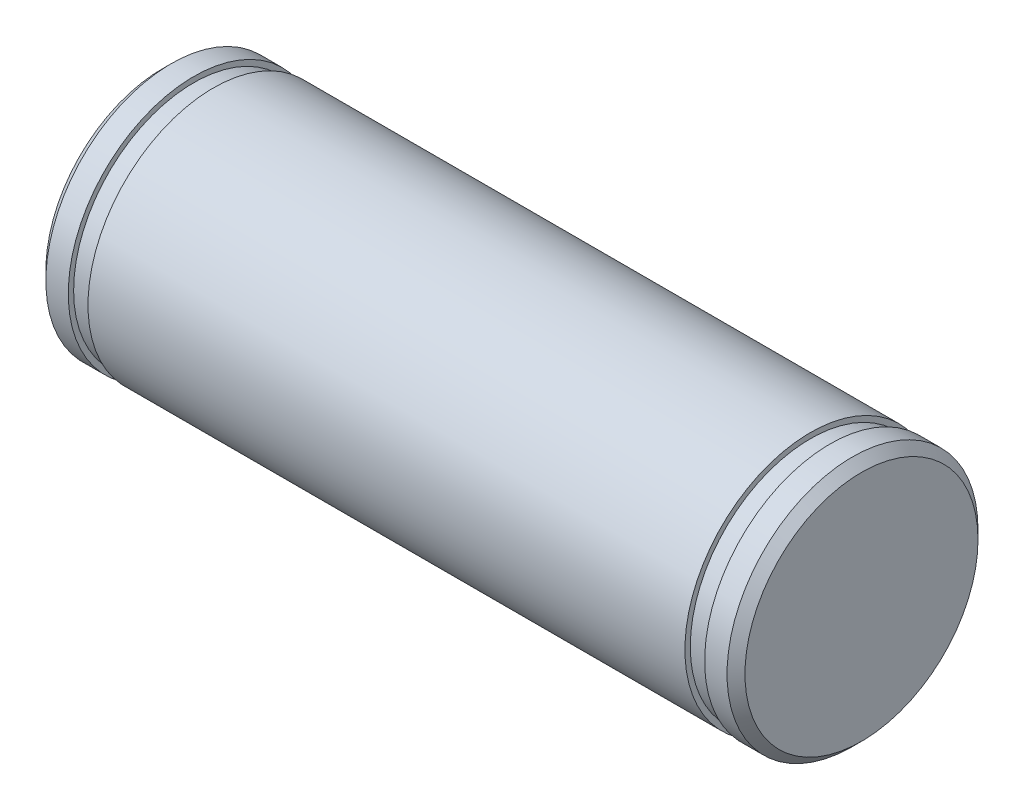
from build123d import *


with BuildPart() as part:
    # Esquisse1 → R_volution2 (revolve)
    with BuildSketch(Plane.XY, mode=Mode.PRIVATE) as r_volution2_sk:
        Polygon((0, 0), (0, 6.5), (0.5, 7), (1.75, 7), (1.75, 6.7), (2.85, 6.7), (2.85, 7), (19.5, 7), (19.5, 0), align=None)
    r_volution2 = revolve(r_volution2_sk.sketch.rotate(Axis((19.5, 0, 0), (-1, 0, 0)), 90), axis=Axis((19.5, 0, 0), (-1, 0, 0)))

    # Sym_trie1: R_volution2 across plane
    add(r_volution2.mirror(Plane(origin=(19.5, 7, 0), x_dir=(0, 0, 1), z_dir=(1, 0, 0))))


solid = part.part
